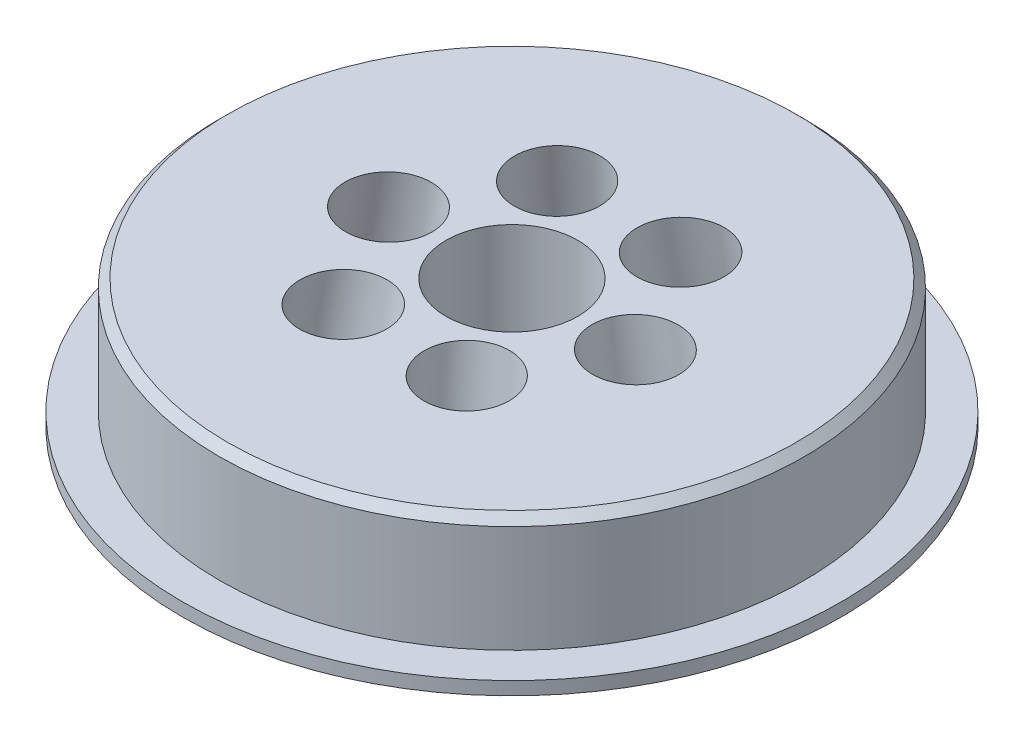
from build123d import *

# Parameters (mm, degrees)
ESQUISSE2_R                  = 4
ENL_V_MAT_EXTRU_1_DEPTH      = 34.526109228
ESQUISSE3_R                  = 2.6
ENL_V_MAT_EXTRU_2_DEPTH      = 37.523667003
R_P_TITION_CIRCULAIRE2_COUNT = 6
CHANFREIN1_SIZE              = 0.5


with BuildPart() as part:
    # Esquisse1 → Base-R_volution (revolve)
    with BuildSketch(Plane.XY, mode=Mode.PRIVATE) as base_r_volution_sk:
        Polygon((0, -18), (0, 0), (-17.75, 0), (-17.75, -7), (-20, -7), (-20, -7.8), (-12.5, -7.8), (-5.5, -8.914953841), (-5.5, -14), (-4.75, -14), (-4.75, -18), align=None)
    revolve(base_r_volution_sk.sketch.rotate(Axis((0, 16.47797058, 0), (0, -1, 0)), 270), axis=Axis((0, 16.47797058, 0), (0, -1, 0)))

    # Esquisse2 → Enl_v. mat.-Extru.1 (cut, through all)
    with BuildSketch(Plane(origin=(0, 0, 0), x_dir=(-1, 0, 0), z_dir=(0, 1, 0))):
        with Locations(Location((0, 0, 0), (0, 0, 90))):
            Circle(ESQUISSE2_R)
    extrude(amount=-ENL_V_MAT_EXTRU_1_DEPTH, mode=Mode.SUBTRACT)

    # Esquisse3 → Enl_v. mat.-Extru.2 (cut, through all)
    with BuildSketch(Plane(origin=(-9, -8.357476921, 0), x_dir=(0, 0, -1), z_dir=(-0.15729632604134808, -0.98755144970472, 0))):
        with Locations(Location((0, 0.174119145, 0), (0, 0, 319.384437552))):
            Circle(ESQUISSE3_R)
    enl_v_mat_extru_2 = extrude(amount=-ENL_V_MAT_EXTRU_2_DEPTH, mode=Mode.SUBTRACT)

    # R_p_tition circulaire2: Enl_v. mat.-Extru.2 ×6 about axis
    r_p_tition_circulaire2_axis = Axis((0, 16.47797058, 0), (0, -1, 0))
    for i in range(1, R_P_TITION_CIRCULAIRE2_COUNT):
        add(enl_v_mat_extru_2.rotate(r_p_tition_circulaire2_axis, i * 360 / R_P_TITION_CIRCULAIRE2_COUNT), mode=Mode.SUBTRACT)

    # Chanfrein1
    chanfrein1_edges = [part.edges().sort_by_distance(p)[0] for p in [
        (0, 0, -17.75),
        (0, -18, -4.75),
    ]]
    chamfer(chanfrein1_edges, length=CHANFREIN1_SIZE)


solid = part.part
